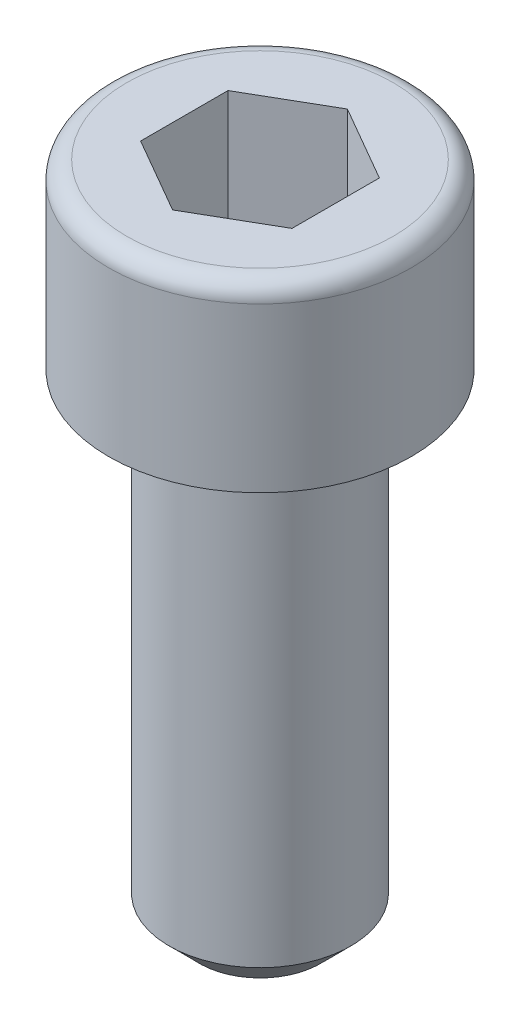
ISO-10303-21;
HEADER;
FILE_DESCRIPTION(('STEP AP214'),'2;1');
FILE_NAME('part.step','',(''),(''),'','','');
FILE_SCHEMA(('AUTOMOTIVE_DESIGN { 1 0 10303 214 1 1 1 1 }'));
ENDSEC;
DATA;
#1=APPLICATION_CONTEXT('core data for automotive mechanical design processes');
#2=APPLICATION_PROTOCOL_DEFINITION('international standard','automotive_design',2000,#1);
#3=PRODUCT_CONTEXT('',#1,'mechanical');
#4=PRODUCT('Part','Part','',(#3));
#5=PRODUCT_RELATED_PRODUCT_CATEGORY('part','',(#4));
#6=PRODUCT_DEFINITION_FORMATION('','',#4);
#7=PRODUCT_DEFINITION_CONTEXT('part definition',#1,'design');
#8=PRODUCT_DEFINITION('design','',#6,#7);
#9=PRODUCT_DEFINITION_SHAPE('','',#8);
#10=(LENGTH_UNIT() NAMED_UNIT(*) SI_UNIT(.MILLI.,.METRE.));
#11=(NAMED_UNIT(*) PLANE_ANGLE_UNIT() SI_UNIT($,.RADIAN.));
#12=(NAMED_UNIT(*) SI_UNIT($,.STERADIAN.) SOLID_ANGLE_UNIT());
#13=UNCERTAINTY_MEASURE_WITH_UNIT(LENGTH_MEASURE(1.E-05),#10,'distance_accuracy_value','');
#14=(GEOMETRIC_REPRESENTATION_CONTEXT(3) GLOBAL_UNCERTAINTY_ASSIGNED_CONTEXT((#13)) GLOBAL_UNIT_ASSIGNED_CONTEXT((#10,
#11,#12)) REPRESENTATION_CONTEXT('',''));
#15=CARTESIAN_POINT('',(0.,0.,0.));
#16=DIRECTION('',(0.,0.,1.));
#17=DIRECTION('',(1.,0.,0.));
#18=AXIS2_PLACEMENT_3D('',#15,#16,#17);
#19=CARTESIAN_POINT('',(2.00000000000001,-22.,0.));
#20=DIRECTION('',(0.,-1.,0.));
#21=DIRECTION('',(1.,0.,0.));
#22=AXIS2_PLACEMENT_3D('',#19,#20,#21);
#23=PLANE('',#22);
#24=CARTESIAN_POINT('',(0.,-22.,0.));
#25=DIRECTION('',(0.,1.,0.));
#26=DIRECTION('',(-1.,0.,0.));
#27=AXIS2_PLACEMENT_3D('',#24,#25,#26);
#28=CIRCLE('',#27,2.);
#29=CARTESIAN_POINT('',(-1.99999999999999,-22.,0.));
#30=VERTEX_POINT('',#29);
#31=EDGE_CURVE('E11',#30,#30,#28,.T.);
#32=ORIENTED_EDGE('',*,*,#31,.F.);
#33=EDGE_LOOP('',(#32));
#34=FACE_BOUND('',#33,.T.);
#35=ADVANCED_FACE('F432',(#34),#23,.T.);
#36=CARTESIAN_POINT('',(0.,-22.,0.));
#37=DIRECTION('',(0.,1.,0.));
#38=DIRECTION('',(-1.,0.,0.));
#39=AXIS2_PLACEMENT_3D('',#36,#37,#38);
#40=CONICAL_SURFACE('',#39,2.,0.785398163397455);
#41=CARTESIAN_POINT('',(0.,-21.,0.));
#42=DIRECTION('',(0.,1.,0.));
#43=DIRECTION('',(-1.,0.,0.));
#44=AXIS2_PLACEMENT_3D('',#41,#42,#43);
#45=CIRCLE('',#44,3.);
#46=CARTESIAN_POINT('',(-2.99999999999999,-21.,0.));
#47=VERTEX_POINT('',#46);
#48=EDGE_CURVE('E439',#47,#47,#45,.T.);
#49=ORIENTED_EDGE('',*,*,#48,.F.);
#50=EDGE_LOOP('',(#49));
#51=FACE_BOUND('',#50,.T.);
#52=ORIENTED_EDGE('',*,*,#31,.T.);
#53=EDGE_LOOP('',(#52));
#54=FACE_BOUND('',#53,.T.);
#55=ADVANCED_FACE('F554',(#51,#54),#40,.T.);
#56=CARTESIAN_POINT('',(0.,65.1172922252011,0.));
#57=DIRECTION('',(0.,1.,0.));
#58=DIRECTION('',(-1.,0.,0.));
#59=AXIS2_PLACEMENT_3D('',#56,#57,#58);
#60=CYLINDRICAL_SURFACE('',#59,2.99999999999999);
#61=ORIENTED_EDGE('',*,*,#48,.T.);
#62=EDGE_LOOP('',(#61));
#63=FACE_BOUND('',#62,.T.);
#64=CARTESIAN_POINT('',(0.,-6.00000000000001,0.));
#65=DIRECTION('',(0.,1.,0.));
#66=DIRECTION('',(-1.,0.,0.));
#67=AXIS2_PLACEMENT_3D('',#64,#65,#66);
#68=CIRCLE('',#67,2.99999999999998);
#69=CARTESIAN_POINT('',(-2.99999999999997,-6.00000000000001,0.));
#70=VERTEX_POINT('',#69);
#71=EDGE_CURVE('E546',#70,#70,#68,.T.);
#72=ORIENTED_EDGE('',*,*,#71,.F.);
#73=EDGE_LOOP('',(#72));
#74=FACE_BOUND('',#73,.T.);
#75=ADVANCED_FACE('F551',(#63,#74),#60,.T.);
#76=CARTESIAN_POINT('',(2.99999999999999,-6.,0.));
#77=DIRECTION('',(0.,1.,0.));
#78=DIRECTION('',(-1.,0.,0.));
#79=AXIS2_PLACEMENT_3D('',#76,#77,#78);
#80=PLANE('',#79);
#81=CARTESIAN_POINT('',(0.,-6.00000000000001,0.));
#82=DIRECTION('',(0.,1.,0.));
#83=DIRECTION('',(-1.,0.,0.));
#84=AXIS2_PLACEMENT_3D('',#81,#82,#83);
#85=CIRCLE('',#84,4.99999999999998);
#86=CARTESIAN_POINT('',(-4.99999999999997,-6.00000000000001,0.));
#87=VERTEX_POINT('',#86);
#88=EDGE_CURVE('E543',#87,#87,#85,.T.);
#89=ORIENTED_EDGE('',*,*,#88,.F.);
#90=EDGE_LOOP('',(#89));
#91=FACE_BOUND('',#90,.T.);
#92=ORIENTED_EDGE('',*,*,#71,.T.);
#93=EDGE_LOOP('',(#92));
#94=FACE_BOUND('',#93,.T.);
#95=ADVANCED_FACE('F572',(#91,#94),#80,.F.);
#96=CARTESIAN_POINT('',(0.,65.1172922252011,0.));
#97=DIRECTION('',(0.,1.,0.));
#98=DIRECTION('',(-1.,0.,0.));
#99=AXIS2_PLACEMENT_3D('',#96,#97,#98);
#100=CYLINDRICAL_SURFACE('',#99,4.99999999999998);
#101=CARTESIAN_POINT('',(0.,-0.600000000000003,0.));
#102=DIRECTION('',(0.,1.,0.));
#103=DIRECTION('',(-1.,0.,0.));
#104=AXIS2_PLACEMENT_3D('',#101,#102,#103);
#105=CIRCLE('',#104,4.99999999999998);
#106=CARTESIAN_POINT('',(-4.99999999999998,-0.600000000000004,0.));
#107=VERTEX_POINT('',#106);
#108=EDGE_CURVE('E540',#107,#107,#105,.T.);
#109=ORIENTED_EDGE('',*,*,#108,.F.);
#110=EDGE_LOOP('',(#109));
#111=FACE_BOUND('',#110,.T.);
#112=ORIENTED_EDGE('',*,*,#88,.T.);
#113=EDGE_LOOP('',(#112));
#114=FACE_BOUND('',#113,.T.);
#115=ADVANCED_FACE('F579',(#111,#114),#100,.T.);
#116=CARTESIAN_POINT('',(0.,-0.600000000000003,0.));
#117=DIRECTION('',(0.,1.,0.));
#118=DIRECTION('',(-1.,0.,0.));
#119=AXIS2_PLACEMENT_3D('',#116,#117,#118);
#120=TOROIDAL_SURFACE('',#119,4.39999999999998,0.6);
#121=CARTESIAN_POINT('',(0.,0.,0.));
#122=DIRECTION('',(0.,1.,0.));
#123=DIRECTION('',(-1.,0.,0.));
#124=AXIS2_PLACEMENT_3D('',#121,#122,#123);
#125=CIRCLE('',#124,4.39999999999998);
#126=CARTESIAN_POINT('',(-4.39999999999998,0.,0.));
#127=VERTEX_POINT('',#126);
#128=EDGE_CURVE('E531',#127,#127,#125,.T.);
#129=ORIENTED_EDGE('',*,*,#128,.F.);
#130=EDGE_LOOP('',(#129));
#131=FACE_BOUND('',#130,.T.);
#132=ORIENTED_EDGE('',*,*,#108,.T.);
#133=EDGE_LOOP('',(#132));
#134=FACE_BOUND('',#133,.T.);
#135=ADVANCED_FACE('F587',(#131,#134),#120,.T.);
#136=CARTESIAN_POINT('',(4.39999999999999,0.,0.));
#137=DIRECTION('',(0.,-1.,0.));
#138=DIRECTION('',(1.,0.,0.));
#139=AXIS2_PLACEMENT_3D('',#136,#137,#138);
#140=PLANE('',#139);
#141=DIRECTION('',(0.,0.,1.));
#142=VECTOR('',#141,1.);
#143=CARTESIAN_POINT('',(-2.5,0.,-1.44337567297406));
#144=LINE('',#143,#142);
#145=CARTESIAN_POINT('',(-2.5,0.,-1.44337567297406));
#146=VERTEX_POINT('',#145);
#147=CARTESIAN_POINT('',(-2.5,0.,1.44337567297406));
#148=VERTEX_POINT('',#147);
#149=EDGE_CURVE('E500',#146,#148,#144,.T.);
#150=ORIENTED_EDGE('',*,*,#149,.F.);
#151=DIRECTION('',(-0.866025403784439,0.,0.5));
#152=VECTOR('',#151,1.);
#153=CARTESIAN_POINT('',(0.,0.,-2.88675134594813));
#154=LINE('',#153,#152);
#155=CARTESIAN_POINT('',(0.,0.,-2.88675134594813));
#156=VERTEX_POINT('',#155);
#157=EDGE_CURVE('E446',#156,#146,#154,.T.);
#158=ORIENTED_EDGE('',*,*,#157,.F.);
#159=DIRECTION('',(0.866025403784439,0.,0.5));
#160=VECTOR('',#159,1.);
#161=CARTESIAN_POINT('',(0.,0.,-2.88675134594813));
#162=LINE('',#161,#160);
#163=CARTESIAN_POINT('',(2.5,0.,-1.44337567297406));
#164=VERTEX_POINT('',#163);
#165=EDGE_CURVE('E515',#156,#164,#162,.T.);
#166=ORIENTED_EDGE('',*,*,#165,.T.);
#167=DIRECTION('',(0.,0.,1.));
#168=VECTOR('',#167,1.);
#169=CARTESIAN_POINT('',(2.5,0.,-1.44337567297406));
#170=LINE('',#169,#168);
#171=CARTESIAN_POINT('',(2.5,0.,1.44337567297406));
#172=VERTEX_POINT('',#171);
#173=EDGE_CURVE('E510',#164,#172,#170,.T.);
#174=ORIENTED_EDGE('',*,*,#173,.T.);
#175=DIRECTION('',(-0.866025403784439,0.,0.5));
#176=VECTOR('',#175,1.);
#177=CARTESIAN_POINT('',(2.5,0.,1.44337567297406));
#178=LINE('',#177,#176);
#179=CARTESIAN_POINT('',(0.,0.,2.88675134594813));
#180=VERTEX_POINT('',#179);
#181=EDGE_CURVE('E508',#172,#180,#178,.T.);
#182=ORIENTED_EDGE('',*,*,#181,.T.);
#183=DIRECTION('',(0.866025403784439,0.,0.5));
#184=VECTOR('',#183,1.);
#185=CARTESIAN_POINT('',(-2.5,0.,1.44337567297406));
#186=LINE('',#185,#184);
#187=EDGE_CURVE('E489',#148,#180,#186,.T.);
#188=ORIENTED_EDGE('',*,*,#187,.F.);
#189=EDGE_LOOP('',(#150,#158,#166,#174,#182,#188));
#190=FACE_BOUND('',#189,.T.);
#191=ORIENTED_EDGE('',*,*,#128,.T.);
#192=EDGE_LOOP('',(#191));
#193=FACE_BOUND('',#192,.T.);
#194=ADVANCED_FACE('F504',(#190,#193),#140,.F.);
#195=CARTESIAN_POINT('',(0.,-4.32,-2.88675134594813));
#196=DIRECTION('',(-0.5,0.,-0.866025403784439));
#197=DIRECTION('',(-0.866025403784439,0.,0.5));
#198=AXIS2_PLACEMENT_3D('',#195,#196,#197);
#199=PLANE('',#198);
#200=ORIENTED_EDGE('',*,*,#157,.T.);
#201=DIRECTION('',(0.,1.,0.));
#202=VECTOR('',#201,1.);
#203=CARTESIAN_POINT('',(-2.5,-4.32,-1.44337567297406));
#204=LINE('',#203,#202);
#205=CARTESIAN_POINT('',(-2.5,-4.32,-1.44337567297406));
#206=VERTEX_POINT('',#205);
#207=EDGE_CURVE('E497',#206,#146,#204,.T.);
#208=ORIENTED_EDGE('',*,*,#207,.F.);
#209=DIRECTION('',(-0.866025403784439,0.,0.5));
#210=VECTOR('',#209,1.);
#211=CARTESIAN_POINT('',(0.,-4.32,-2.88675134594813));
#212=LINE('',#211,#210);
#213=CARTESIAN_POINT('',(0.,-4.32,-2.88675134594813));
#214=VERTEX_POINT('',#213);
#215=EDGE_CURVE('E518',#214,#206,#212,.T.);
#216=ORIENTED_EDGE('',*,*,#215,.F.);
#217=DIRECTION('',(0.,1.,0.));
#218=VECTOR('',#217,1.);
#219=CARTESIAN_POINT('',(0.,-4.32,-2.88675134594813));
#220=LINE('',#219,#218);
#221=EDGE_CURVE('E453',#214,#156,#220,.T.);
#222=ORIENTED_EDGE('',*,*,#221,.T.);
#223=EDGE_LOOP('',(#200,#208,#216,#222));
#224=FACE_BOUND('',#223,.T.);
#225=ADVANCED_FACE('F602',(#224),#199,.F.);
#226=CARTESIAN_POINT('',(0.,-4.32,-2.88675134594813));
#227=DIRECTION('',(-0.5,0.,0.866025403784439));
#228=DIRECTION('',(0.866025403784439,0.,0.5));
#229=AXIS2_PLACEMENT_3D('',#226,#227,#228);
#230=PLANE('',#229);
#231=ORIENTED_EDGE('',*,*,#165,.F.);
#232=ORIENTED_EDGE('',*,*,#221,.F.);
#233=DIRECTION('',(0.866025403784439,0.,0.5));
#234=VECTOR('',#233,1.);
#235=CARTESIAN_POINT('',(0.,-4.32,-2.88675134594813));
#236=LINE('',#235,#234);
#237=CARTESIAN_POINT('',(2.5,-4.32,-1.44337567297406));
#238=VERTEX_POINT('',#237);
#239=EDGE_CURVE('E528',#214,#238,#236,.T.);
#240=ORIENTED_EDGE('',*,*,#239,.T.);
#241=DIRECTION('',(0.,1.,0.));
#242=VECTOR('',#241,1.);
#243=CARTESIAN_POINT('',(2.5,-4.32,-1.44337567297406));
#244=LINE('',#243,#242);
#245=EDGE_CURVE('E532',#238,#164,#244,.T.);
#246=ORIENTED_EDGE('',*,*,#245,.T.);
#247=EDGE_LOOP('',(#231,#232,#240,#246));
#248=FACE_BOUND('',#247,.T.);
#249=ADVANCED_FACE('F609',(#248),#230,.T.);
#250=CARTESIAN_POINT('',(2.5,-4.32,-1.44337567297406));
#251=DIRECTION('',(-1.,0.,0.));
#252=DIRECTION('',(0.,-1.,0.));
#253=AXIS2_PLACEMENT_3D('',#250,#251,#252);
#254=PLANE('',#253);
#255=ORIENTED_EDGE('',*,*,#173,.F.);
#256=ORIENTED_EDGE('',*,*,#245,.F.);
#257=DIRECTION('',(0.,0.,1.));
#258=VECTOR('',#257,1.);
#259=CARTESIAN_POINT('',(2.5,-4.32,-1.44337567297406));
#260=LINE('',#259,#258);
#261=CARTESIAN_POINT('',(2.5,-4.32,1.44337567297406));
#262=VERTEX_POINT('',#261);
#263=EDGE_CURVE('E526',#238,#262,#260,.T.);
#264=ORIENTED_EDGE('',*,*,#263,.T.);
#265=DIRECTION('',(0.,1.,0.));
#266=VECTOR('',#265,1.);
#267=CARTESIAN_POINT('',(2.5,-4.32,1.44337567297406));
#268=LINE('',#267,#266);
#269=EDGE_CURVE('E534',#262,#172,#268,.T.);
#270=ORIENTED_EDGE('',*,*,#269,.T.);
#271=EDGE_LOOP('',(#255,#256,#264,#270));
#272=FACE_BOUND('',#271,.T.);
#273=ADVANCED_FACE('F616',(#272),#254,.T.);
#274=CARTESIAN_POINT('',(2.5,-4.32,1.44337567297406));
#275=DIRECTION('',(-0.5,0.,-0.866025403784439));
#276=DIRECTION('',(-0.866025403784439,0.,0.5));
#277=AXIS2_PLACEMENT_3D('',#274,#275,#276);
#278=PLANE('',#277);
#279=ORIENTED_EDGE('',*,*,#181,.F.);
#280=ORIENTED_EDGE('',*,*,#269,.F.);
#281=DIRECTION('',(-0.866025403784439,0.,0.5));
#282=VECTOR('',#281,1.);
#283=CARTESIAN_POINT('',(2.5,-4.32,1.44337567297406));
#284=LINE('',#283,#282);
#285=CARTESIAN_POINT('',(0.,-4.32,2.88675134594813));
#286=VERTEX_POINT('',#285);
#287=EDGE_CURVE('E524',#262,#286,#284,.T.);
#288=ORIENTED_EDGE('',*,*,#287,.T.);
#289=DIRECTION('',(0.,1.,0.));
#290=VECTOR('',#289,1.);
#291=CARTESIAN_POINT('',(0.,-4.32,2.88675134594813));
#292=LINE('',#291,#290);
#293=EDGE_CURVE('E496',#286,#180,#292,.T.);
#294=ORIENTED_EDGE('',*,*,#293,.T.);
#295=EDGE_LOOP('',(#279,#280,#288,#294));
#296=FACE_BOUND('',#295,.T.);
#297=ADVANCED_FACE('F623',(#296),#278,.T.);
#298=CARTESIAN_POINT('',(-2.5,-4.32,1.44337567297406));
#299=DIRECTION('',(-0.5,0.,0.866025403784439));
#300=DIRECTION('',(0.866025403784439,0.,0.5));
#301=AXIS2_PLACEMENT_3D('',#298,#299,#300);
#302=PLANE('',#301);
#303=ORIENTED_EDGE('',*,*,#187,.T.);
#304=ORIENTED_EDGE('',*,*,#293,.F.);
#305=DIRECTION('',(0.866025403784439,0.,0.5));
#306=VECTOR('',#305,1.);
#307=CARTESIAN_POINT('',(-2.5,-4.32,1.44337567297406));
#308=LINE('',#307,#306);
#309=CARTESIAN_POINT('',(-2.5,-4.32,1.44337567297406));
#310=VERTEX_POINT('',#309);
#311=EDGE_CURVE('E492',#310,#286,#308,.T.);
#312=ORIENTED_EDGE('',*,*,#311,.F.);
#313=DIRECTION('',(0.,1.,0.));
#314=VECTOR('',#313,1.);
#315=CARTESIAN_POINT('',(-2.5,-4.32,1.44337567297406));
#316=LINE('',#315,#314);
#317=EDGE_CURVE('E484',#310,#148,#316,.T.);
#318=ORIENTED_EDGE('',*,*,#317,.T.);
#319=EDGE_LOOP('',(#303,#304,#312,#318));
#320=FACE_BOUND('',#319,.T.);
#321=ADVANCED_FACE('F486',(#320),#302,.F.);
#322=CARTESIAN_POINT('',(-2.5,-4.32,-1.44337567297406));
#323=DIRECTION('',(-1.,0.,0.));
#324=DIRECTION('',(0.,-1.,0.));
#325=AXIS2_PLACEMENT_3D('',#322,#323,#324);
#326=PLANE('',#325);
#327=ORIENTED_EDGE('',*,*,#149,.T.);
#328=ORIENTED_EDGE('',*,*,#317,.F.);
#329=DIRECTION('',(0.,0.,1.));
#330=VECTOR('',#329,1.);
#331=CARTESIAN_POINT('',(-2.5,-4.32,-1.44337567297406));
#332=LINE('',#331,#330);
#333=EDGE_CURVE('E521',#206,#310,#332,.T.);
#334=ORIENTED_EDGE('',*,*,#333,.F.);
#335=ORIENTED_EDGE('',*,*,#207,.T.);
#336=EDGE_LOOP('',(#327,#328,#334,#335));
#337=FACE_BOUND('',#336,.T.);
#338=ADVANCED_FACE('F501',(#337),#326,.F.);
#339=CARTESIAN_POINT('',(-2.5,-4.32,-1.44337567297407));
#340=DIRECTION('',(0.,1.,0.));
#341=DIRECTION('',(-1.,0.,0.));
#342=AXIS2_PLACEMENT_3D('',#339,#340,#341);
#343=PLANE('',#342);
#344=ORIENTED_EDGE('',*,*,#215,.T.);
#345=ORIENTED_EDGE('',*,*,#333,.T.);
#346=ORIENTED_EDGE('',*,*,#311,.T.);
#347=ORIENTED_EDGE('',*,*,#287,.F.);
#348=ORIENTED_EDGE('',*,*,#263,.F.);
#349=ORIENTED_EDGE('',*,*,#239,.F.);
#350=EDGE_LOOP('',(#344,#345,#346,#347,#348,#349));
#351=FACE_BOUND('',#350,.T.);
#352=ADVANCED_FACE('F644',(#351),#343,.T.);
#353=CLOSED_SHELL('',(#35,#55,#75,#95,#115,#135,#194,#225,#249,#273,#297,#321,#338,#352));
#354=MANIFOLD_SOLID_BREP('B2',#353);
#355=ADVANCED_BREP_SHAPE_REPRESENTATION('',(#18,#354),#14);
#356=SHAPE_DEFINITION_REPRESENTATION(#9,#355);
ENDSEC;
END-ISO-10303-21;
